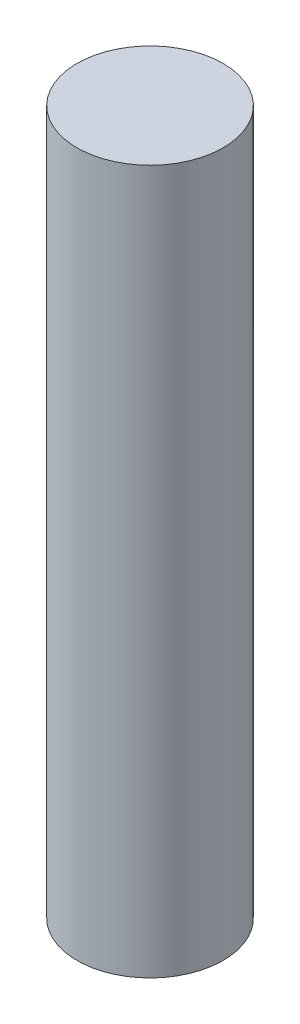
ISO-10303-21;
HEADER;
FILE_DESCRIPTION(('STEP AP214'),'2;1');
FILE_NAME('part.step','',(''),(''),'','','');
FILE_SCHEMA(('AUTOMOTIVE_DESIGN { 1 0 10303 214 1 1 1 1 }'));
ENDSEC;
DATA;
#1=APPLICATION_CONTEXT('core data for automotive mechanical design processes');
#2=APPLICATION_PROTOCOL_DEFINITION('international standard','automotive_design',2000,#1);
#3=PRODUCT_CONTEXT('',#1,'mechanical');
#4=PRODUCT('Part','Part','',(#3));
#5=PRODUCT_RELATED_PRODUCT_CATEGORY('part','',(#4));
#6=PRODUCT_DEFINITION_FORMATION('','',#4);
#7=PRODUCT_DEFINITION_CONTEXT('part definition',#1,'design');
#8=PRODUCT_DEFINITION('design','',#6,#7);
#9=PRODUCT_DEFINITION_SHAPE('','',#8);
#10=(LENGTH_UNIT() NAMED_UNIT(*) SI_UNIT(.MILLI.,.METRE.));
#11=(NAMED_UNIT(*) PLANE_ANGLE_UNIT() SI_UNIT($,.RADIAN.));
#12=(NAMED_UNIT(*) SI_UNIT($,.STERADIAN.) SOLID_ANGLE_UNIT());
#13=UNCERTAINTY_MEASURE_WITH_UNIT(LENGTH_MEASURE(1.E-05),#10,'distance_accuracy_value','');
#14=(GEOMETRIC_REPRESENTATION_CONTEXT(3) GLOBAL_UNCERTAINTY_ASSIGNED_CONTEXT((#13)) GLOBAL_UNIT_ASSIGNED_CONTEXT((#10,
#11,#12)) REPRESENTATION_CONTEXT('',''));
#15=CARTESIAN_POINT('',(0.,0.,0.));
#16=DIRECTION('',(0.,0.,1.));
#17=DIRECTION('',(1.,0.,0.));
#18=AXIS2_PLACEMENT_3D('',#15,#16,#17);
#19=CARTESIAN_POINT('',(0.,13.,0.));
#20=DIRECTION('',(0.,-1.,0.));
#21=DIRECTION('',(0.,0.,-1.));
#22=AXIS2_PLACEMENT_3D('',#19,#20,#21);
#23=CYLINDRICAL_SURFACE('',#22,1.35);
#24=CARTESIAN_POINT('',(0.,13.,0.));
#25=DIRECTION('',(0.,1.,0.));
#26=DIRECTION('',(0.,0.,1.));
#27=AXIS2_PLACEMENT_3D('',#24,#25,#26);
#28=CIRCLE('',#27,1.35);
#29=CARTESIAN_POINT('',(0.,13.,-1.35));
#30=VERTEX_POINT('',#29);
#31=EDGE_CURVE('E10',#30,#30,#28,.T.);
#32=CARTESIAN_POINT('',(0.,0.,0.));
#33=DIRECTION('',(0.,1.,0.));
#34=DIRECTION('',(0.,0.,1.));
#35=AXIS2_PLACEMENT_3D('',#32,#33,#34);
#36=CIRCLE('',#35,1.35);
#37=CARTESIAN_POINT('',(0.,0.,-1.35));
#38=VERTEX_POINT('',#37);
#39=EDGE_CURVE('E40',#38,#38,#36,.T.);
#40=CARTESIAN_POINT('',(0.,13.,-1.35));
#41=CARTESIAN_POINT('',(0.,12.8645833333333,-1.35));
#42=CARTESIAN_POINT('',(0.,12.7291666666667,-1.35));
#43=CARTESIAN_POINT('',(0.,12.4583333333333,-1.35));
#44=CARTESIAN_POINT('',(0.,12.3229166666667,-1.35));
#45=CARTESIAN_POINT('',(0.,12.0520833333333,-1.35));
#46=CARTESIAN_POINT('',(0.,11.9166666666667,-1.35));
#47=CARTESIAN_POINT('',(0.,11.6458333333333,-1.35));
#48=CARTESIAN_POINT('',(0.,11.5104166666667,-1.35));
#49=CARTESIAN_POINT('',(0.,11.2395833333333,-1.35));
#50=CARTESIAN_POINT('',(0.,11.1041666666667,-1.35));
#51=CARTESIAN_POINT('',(0.,10.8333333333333,-1.35));
#52=CARTESIAN_POINT('',(0.,10.6979166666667,-1.35));
#53=CARTESIAN_POINT('',(0.,10.4270833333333,-1.35));
#54=CARTESIAN_POINT('',(0.,10.2916666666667,-1.35));
#55=CARTESIAN_POINT('',(0.,10.0208333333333,-1.35));
#56=CARTESIAN_POINT('',(0.,9.88541666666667,-1.35));
#57=CARTESIAN_POINT('',(0.,9.61458333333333,-1.35));
#58=CARTESIAN_POINT('',(0.,9.47916666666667,-1.35));
#59=CARTESIAN_POINT('',(0.,9.20833333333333,-1.35));
#60=CARTESIAN_POINT('',(0.,9.07291666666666,-1.35));
#61=CARTESIAN_POINT('',(0.,8.80208333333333,-1.35));
#62=CARTESIAN_POINT('',(0.,8.66666666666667,-1.35));
#63=CARTESIAN_POINT('',(0.,8.39583333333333,-1.35));
#64=CARTESIAN_POINT('',(0.,8.26041666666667,-1.35));
#65=CARTESIAN_POINT('',(0.,7.98958333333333,-1.35));
#66=CARTESIAN_POINT('',(0.,7.85416666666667,-1.35));
#67=CARTESIAN_POINT('',(0.,7.58333333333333,-1.35));
#68=CARTESIAN_POINT('',(0.,7.44791666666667,-1.35));
#69=CARTESIAN_POINT('',(0.,7.17708333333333,-1.35));
#70=CARTESIAN_POINT('',(0.,7.04166666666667,-1.35));
#71=CARTESIAN_POINT('',(0.,6.77083333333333,-1.35));
#72=CARTESIAN_POINT('',(0.,6.63541666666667,-1.35));
#73=CARTESIAN_POINT('',(0.,6.36458333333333,-1.35));
#74=CARTESIAN_POINT('',(0.,6.22916666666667,-1.35));
#75=CARTESIAN_POINT('',(0.,5.95833333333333,-1.35));
#76=CARTESIAN_POINT('',(0.,5.82291666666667,-1.35));
#77=CARTESIAN_POINT('',(0.,5.55208333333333,-1.35));
#78=CARTESIAN_POINT('',(0.,5.41666666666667,-1.35));
#79=CARTESIAN_POINT('',(0.,5.14583333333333,-1.35));
#80=CARTESIAN_POINT('',(0.,5.01041666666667,-1.35));
#81=CARTESIAN_POINT('',(0.,4.73958333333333,-1.35));
#82=CARTESIAN_POINT('',(0.,4.60416666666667,-1.35));
#83=CARTESIAN_POINT('',(0.,4.33333333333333,-1.35));
#84=CARTESIAN_POINT('',(0.,4.19791666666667,-1.35));
#85=CARTESIAN_POINT('',(0.,3.92708333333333,-1.35));
#86=CARTESIAN_POINT('',(0.,3.79166666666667,-1.35));
#87=CARTESIAN_POINT('',(0.,3.52083333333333,-1.35));
#88=CARTESIAN_POINT('',(0.,3.38541666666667,-1.35));
#89=CARTESIAN_POINT('',(0.,3.11458333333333,-1.35));
#90=CARTESIAN_POINT('',(0.,2.97916666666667,-1.35));
#91=CARTESIAN_POINT('',(0.,2.70833333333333,-1.35));
#92=CARTESIAN_POINT('',(0.,2.57291666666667,-1.35));
#93=CARTESIAN_POINT('',(0.,2.30208333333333,-1.35));
#94=CARTESIAN_POINT('',(0.,2.16666666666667,-1.35));
#95=CARTESIAN_POINT('',(0.,1.89583333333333,-1.35));
#96=CARTESIAN_POINT('',(0.,1.76041666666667,-1.35));
#97=CARTESIAN_POINT('',(0.,1.48958333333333,-1.35));
#98=CARTESIAN_POINT('',(0.,1.35416666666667,-1.35));
#99=CARTESIAN_POINT('',(0.,1.08333333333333,-1.35));
#100=CARTESIAN_POINT('',(0.,0.947916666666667,-1.35));
#101=CARTESIAN_POINT('',(0.,0.677083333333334,-1.35));
#102=CARTESIAN_POINT('',(0.,0.541666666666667,-1.35));
#103=CARTESIAN_POINT('',(0.,0.270833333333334,-1.35));
#104=CARTESIAN_POINT('',(0.,0.135416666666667,-1.35));
#105=CARTESIAN_POINT('',(0.,0.,-1.35));
#106=B_SPLINE_CURVE_WITH_KNOTS('',3,(#40,#41,#42,#43,#44,#45,#46,#47,#48,#49,#50,#51,#52,#53,
#54,#55,#56,#57,#58,#59,#60,#61,#62,#63,#64,#65,#66,#67,#68,#69,#70,#71,#72,#73,#74,#75,#76,#77,
#78,#79,#80,#81,#82,#83,#84,#85,#86,#87,#88,#89,#90,#91,#92,#93,#94,#95,#96,#97,#98,#99,#100,
#101,#102,#103,#104,#105),.UNSPECIFIED.,.F.,.F.,(4,2,2,2,2,2,2,2,2,2,2,2,2,2,2,2,2,2,2,2,2,2,2,
2,2,2,2,2,2,2,2,2,4),(0.,0.40625,0.812500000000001,1.21875,1.625,2.03125,2.4375,2.84375,3.25,
3.65625,4.0625,4.46875,4.875,5.28125,5.6875,6.09375,6.5,6.90625,7.3125,7.71875,8.125,8.53125,
8.9375,9.34375,9.75,10.15625,10.5625,10.96875,11.375,11.78125,12.1875,12.59375,13.),.UNSPECIFIED.);
#107=EDGE_CURVE('BSEAM37',#30,#38,#106,.T.);
#108=ORIENTED_EDGE('',*,*,#31,.F.);
#109=ORIENTED_EDGE('',*,*,#39,.T.);
#110=ORIENTED_EDGE('',*,*,#107,.T.);
#111=ORIENTED_EDGE('',*,*,#107,.F.);
#112=EDGE_LOOP('',(#108,#110,#109,#111));
#113=FACE_BOUND('',#112,.T.);
#114=ADVANCED_FACE('F37',(#113),#23,.T.);
#115=CARTESIAN_POINT('',(0.,13.,0.));
#116=DIRECTION('',(0.,1.,0.));
#117=DIRECTION('',(0.,0.,1.));
#118=AXIS2_PLACEMENT_3D('',#115,#116,#117);
#119=PLANE('',#118);
#120=ORIENTED_EDGE('',*,*,#31,.T.);
#121=EDGE_LOOP('',(#120));
#122=FACE_BOUND('',#121,.T.);
#123=ADVANCED_FACE('F52',(#122),#119,.T.);
#124=CARTESIAN_POINT('',(0.,0.,0.));
#125=DIRECTION('',(0.,1.,0.));
#126=DIRECTION('',(0.,0.,1.));
#127=AXIS2_PLACEMENT_3D('',#124,#125,#126);
#128=PLANE('',#127);
#129=ORIENTED_EDGE('',*,*,#39,.F.);
#130=EDGE_LOOP('',(#129));
#131=FACE_BOUND('',#130,.T.);
#132=ADVANCED_FACE('F50',(#131),#128,.F.);
#133=CLOSED_SHELL('',(#114,#123,#132));
#134=MANIFOLD_SOLID_BREP('B2',#133);
#135=ADVANCED_BREP_SHAPE_REPRESENTATION('',(#18,#134),#14);
#136=SHAPE_DEFINITION_REPRESENTATION(#9,#135);
ENDSEC;
END-ISO-10303-21;
